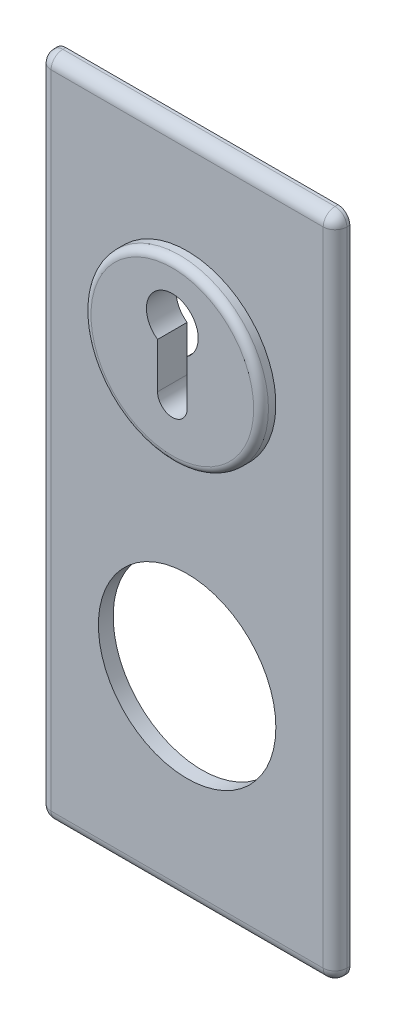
from build123d import *

# Parameters (mm, degrees)
SKETCH2_W           = 50.8
SKETCH2_H           = 114.3
BOSS_EXTRUDE1_DEPTH = 2.54
FILLET1_R           = 2.032
SKETCH3_R           = 15.24
CUT_EXTRUDE1_DEPTH  = 63.591805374
SKETCH4_R           = 15.24
BOSS_EXTRUDE2_DEPTH = 2.54
FILLET2_R           = 1.27
SKETCH21_R          = 4.445
CUT_EXTRUDE11_DEPTH = 25.4


with BuildPart() as part:
    # Sketch2 → Boss-Extrude1 (new body)
    with BuildSketch(Plane.XY):
        Rectangle(SKETCH2_W, SKETCH2_H)
    extrude(amount=BOSS_EXTRUDE1_DEPTH)

    # Fillet1
    fillet1_edges = [part.edges().sort_by_distance(p)[0] for p in [
        (-25.4, 0, 2.54),
        (0, -57.15, 2.54),
        (25.4, 0, 2.54),
        (0, 57.15, 2.54),
        (25.4, -57.15, 1.27),
        (-25.4, -57.15, 1.27),
        (-25.4, 57.15, 1.27),
        (25.4, 57.15, 1.27),
    ]]
    fillet(fillet1_edges, radius=FILLET1_R)

    # Sketch3 → Cut-Extrude1 (cut, through all)
    with BuildSketch(Plane.XY.offset(2.54)):
        with Locations((0, -23.368)):
            Circle(SKETCH3_R)
    extrude(amount=-CUT_EXTRUDE1_DEPTH, mode=Mode.SUBTRACT)

    # Sketch4 → Boss-Extrude2 (add)
    with BuildSketch(Plane.XY.offset(2.54)):
        with Locations(Location((0, 24.638, 0), (0, 0, 180))):
            Circle(SKETCH4_R)
    extrude(amount=BOSS_EXTRUDE2_DEPTH)

    # Fillet2
    fillet2_edges = [part.edges().sort_by_distance(p)[0] for p in [
        (15.24, 24.638, 5.08),
    ]]
    fillet(fillet2_edges, radius=FILLET2_R)

    # Sketch21 → Cut-Extrude11 (cut)
    with BuildSketch(Plane(origin=(0.41869013, 23.6586702, 5.08), x_dir=(1, 0, 0), z_dir=(0, 0, 1))):
        with Locations((-0.41869013, 6.6943298)):
            Circle(SKETCH21_R)
        with BuildLine():
            Line((2.12130987, 6.6943298), (2.12130987, -4.7356702))
            ThreePointArc((2.12130987, -4.7356702), (-0.41869013, -7.2756702), (-2.95869013, -4.7356702))
            Line((-2.95869013, -4.7356702), (-2.95869013, 6.6943298))
            ThreePointArc((-2.95869013, 6.6943298), (-0.41869013, 9.2343298), (2.12130987, 6.6943298))
        make_face()
    extrude(amount=-CUT_EXTRUDE11_DEPTH, mode=Mode.SUBTRACT)


solid = part.part
